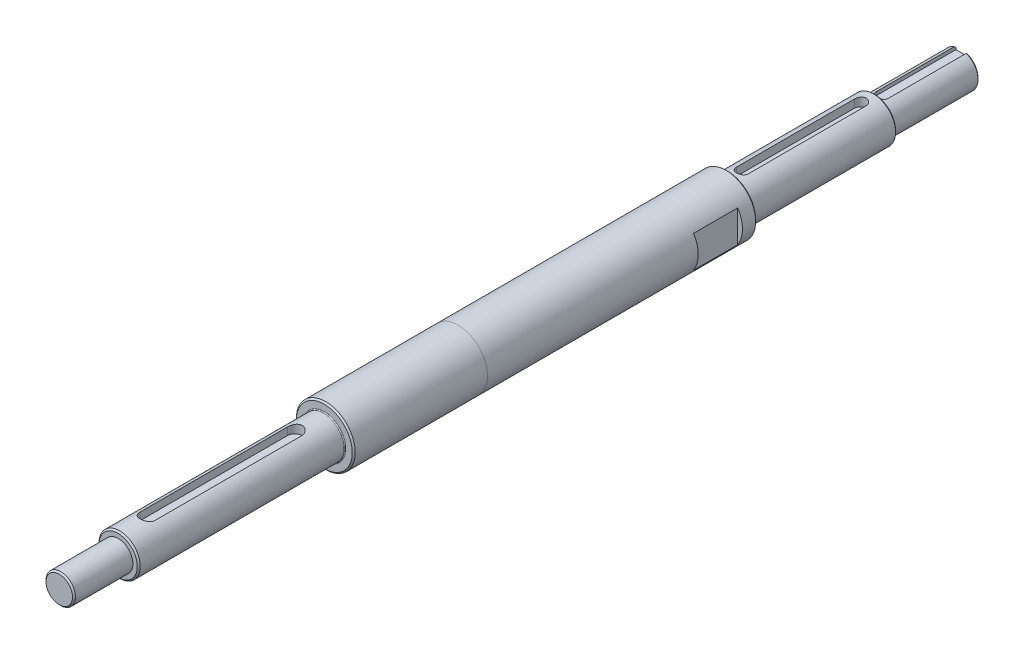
ISO-10303-21;
HEADER;
FILE_DESCRIPTION(('STEP AP214'),'2;1');
FILE_NAME('part.step','',(''),(''),'','','');
FILE_SCHEMA(('AUTOMOTIVE_DESIGN { 1 0 10303 214 1 1 1 1 }'));
ENDSEC;
DATA;
#1=APPLICATION_CONTEXT('core data for automotive mechanical design processes');
#2=APPLICATION_PROTOCOL_DEFINITION('international standard','automotive_design',2000,#1);
#3=PRODUCT_CONTEXT('',#1,'mechanical');
#4=PRODUCT('Part','Part','',(#3));
#5=PRODUCT_RELATED_PRODUCT_CATEGORY('part','',(#4));
#6=PRODUCT_DEFINITION_FORMATION('','',#4);
#7=PRODUCT_DEFINITION_CONTEXT('part definition',#1,'design');
#8=PRODUCT_DEFINITION('design','',#6,#7);
#9=PRODUCT_DEFINITION_SHAPE('','',#8);
#10=(LENGTH_UNIT() NAMED_UNIT(*) SI_UNIT(.MILLI.,.METRE.));
#11=(NAMED_UNIT(*) PLANE_ANGLE_UNIT() SI_UNIT($,.RADIAN.));
#12=(NAMED_UNIT(*) SI_UNIT($,.STERADIAN.) SOLID_ANGLE_UNIT());
#13=UNCERTAINTY_MEASURE_WITH_UNIT(LENGTH_MEASURE(1.E-05),#10,'distance_accuracy_value','');
#14=(GEOMETRIC_REPRESENTATION_CONTEXT(3) GLOBAL_UNCERTAINTY_ASSIGNED_CONTEXT((#13)) GLOBAL_UNIT_ASSIGNED_CONTEXT((#10,
#11,#12)) REPRESENTATION_CONTEXT('',''));
#15=CARTESIAN_POINT('',(0.,0.,0.));
#16=DIRECTION('',(0.,0.,1.));
#17=DIRECTION('',(1.,0.,0.));
#18=AXIS2_PLACEMENT_3D('',#15,#16,#17);
#19=CARTESIAN_POINT('',(0.,0.,0.));
#20=DIRECTION('',(0.,0.,1.));
#21=DIRECTION('',(1.,0.,0.));
#22=AXIS2_PLACEMENT_3D('',#19,#20,#21);
#23=CYLINDRICAL_SURFACE('',#22,9.99999999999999);
#24=CARTESIAN_POINT('',(0.,0.,-90.5));
#25=DIRECTION('',(0.,0.,-1.));
#26=DIRECTION('',(-1.,0.,0.));
#27=AXIS2_PLACEMENT_3D('',#24,#25,#26);
#28=CIRCLE('',#27,9.99999999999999);
#29=CARTESIAN_POINT('',(-9.99999999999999,0.,-90.5));
#30=VERTEX_POINT('',#29);
#31=EDGE_CURVE('E329',#30,#30,#28,.T.);
#32=ORIENTED_EDGE('',*,*,#31,.T.);
#33=EDGE_LOOP('',(#32));
#34=FACE_BOUND('',#33,.T.);
#35=CARTESIAN_POINT('',(0.,0.,-135.473865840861));
#36=DIRECTION('',(0.,0.,-1.));
#37=DIRECTION('',(-1.,0.,0.));
#38=AXIS2_PLACEMENT_3D('',#35,#36,#37);
#39=CIRCLE('',#38,9.99999999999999);
#40=CARTESIAN_POINT('',(-9.99999999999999,0.,-135.473865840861));
#41=VERTEX_POINT('',#40);
#42=EDGE_CURVE('E11',#41,#41,#39,.T.);
#43=ORIENTED_EDGE('',*,*,#42,.F.);
#44=EDGE_LOOP('',(#43));
#45=FACE_BOUND('',#44,.T.);
#46=ADVANCED_FACE('F39',(#34,#45),#23,.T.);
#47=CARTESIAN_POINT('',(0.,0.,0.));
#48=DIRECTION('',(0.,0.,1.));
#49=DIRECTION('',(1.,0.,0.));
#50=AXIS2_PLACEMENT_3D('',#47,#48,#49);
#51=CYLINDRICAL_SURFACE('',#50,7.5);
#52=CARTESIAN_POINT('',(0.,0.,-227.));
#53=DIRECTION('',(0.,0.,1.));
#54=DIRECTION('',(1.,0.,0.));
#55=AXIS2_PLACEMENT_3D('',#52,#53,#54);
#56=CIRCLE('',#55,7.5);
#57=CARTESIAN_POINT('',(7.5,0.,-227.));
#58=VERTEX_POINT('',#57);
#59=EDGE_CURVE('E260',#58,#58,#56,.T.);
#60=ORIENTED_EDGE('',*,*,#59,.F.);
#61=EDGE_LOOP('',(#60));
#62=FACE_BOUND('',#61,.T.);
#63=CARTESIAN_POINT('',(0.,0.,-276.5));
#64=DIRECTION('',(0.,0.,1.));
#65=DIRECTION('',(1.,0.,0.));
#66=AXIS2_PLACEMENT_3D('',#63,#64,#65);
#67=CIRCLE('',#66,7.5);
#68=CARTESIAN_POINT('',(7.5,0.,-276.5));
#69=VERTEX_POINT('',#68);
#70=EDGE_CURVE('E316',#69,#69,#67,.T.);
#71=ORIENTED_EDGE('',*,*,#70,.T.);
#72=EDGE_LOOP('',(#71));
#73=FACE_BOUND('',#72,.T.);
#74=CARTESIAN_POINT('',(-2.00000000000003,7.22841614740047,-232.));
#75=CARTESIAN_POINT('',(-2.00000081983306,7.22841211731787,-231.944805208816));
#76=CARTESIAN_POINT('',(-1.99771369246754,7.22904913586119,-231.88963790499));
#77=CARTESIAN_POINT('',(-1.98859723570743,7.23156375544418,-231.779718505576));
#78=CARTESIAN_POINT('',(-1.98176874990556,7.23344112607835,-231.724966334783));
#79=CARTESIAN_POINT('',(-1.9545755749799,7.2408568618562,-231.562171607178));
#80=CARTESIAN_POINT('',(-1.92750268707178,7.24817935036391,-231.455251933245));
#81=CARTESIAN_POINT('',(-1.85636209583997,7.26672221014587,-231.247687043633));
#82=CARTESIAN_POINT('',(-1.81229733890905,7.27794190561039,-231.147040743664));
#83=CARTESIAN_POINT('',(-1.70848322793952,7.30300813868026,-230.954511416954));
#84=CARTESIAN_POINT('',(-1.64872869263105,7.31685554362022,-230.86263129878));
#85=CARTESIAN_POINT('',(-1.51365040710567,7.34600093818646,-230.688008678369));
#86=CARTESIAN_POINT('',(-1.43800740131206,7.36132450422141,-230.605517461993));
#87=CARTESIAN_POINT('',(-1.2739794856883,7.39147614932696,-230.454222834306));
#88=CARTESIAN_POINT('',(-1.18559251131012,7.40630414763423,-230.385421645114));
#89=CARTESIAN_POINT('',(-0.996835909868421,7.43408021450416,-230.262413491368));
#90=CARTESIAN_POINT('',(-0.896297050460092,7.44699437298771,-230.208457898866));
#91=CARTESIAN_POINT('',(-0.68717790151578,7.4691917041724,-230.118313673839));
#92=CARTESIAN_POINT('',(-0.57859935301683,7.47847566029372,-230.082121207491));
#93=CARTESIAN_POINT('',(-0.359117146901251,7.49218546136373,-230.02934505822));
#94=CARTESIAN_POINT('',(-0.248323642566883,7.49671766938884,-230.012331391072));
#95=CARTESIAN_POINT('',(-0.0253660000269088,7.5007852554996,-229.997042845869));
#96=CARTESIAN_POINT('',(0.0867979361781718,7.50032136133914,-229.99876523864));
#97=CARTESIAN_POINT('',(0.306314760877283,7.49452674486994,-230.020597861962));
#98=CARTESIAN_POINT('',(0.413717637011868,7.48931908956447,-230.040243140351));
#99=CARTESIAN_POINT('',(0.623642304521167,7.47476739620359,-230.096612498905));
#100=CARTESIAN_POINT('',(0.726163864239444,7.46542316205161,-230.133337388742));
#101=CARTESIAN_POINT('',(0.924604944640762,7.44346557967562,-230.223180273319));
#102=CARTESIAN_POINT('',(1.02044860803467,7.43082062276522,-230.276457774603));
#103=CARTESIAN_POINT('',(1.20199173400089,7.40362439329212,-230.397770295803));
#104=CARTESIAN_POINT('',(1.28768941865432,7.38907278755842,-230.465807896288));
#105=CARTESIAN_POINT('',(1.44927650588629,7.35911436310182,-230.617168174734));
#106=CARTESIAN_POINT('',(1.52478554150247,7.34369500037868,-230.700894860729));
#107=CARTESIAN_POINT('',(1.66080031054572,7.31413713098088,-230.880005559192));
#108=CARTESIAN_POINT('',(1.72130189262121,7.29999897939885,-230.975392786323));
#109=CARTESIAN_POINT('',(1.82587959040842,7.27455088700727,-231.175957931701));
#110=CARTESIAN_POINT('',(1.86984307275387,7.26326050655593,-231.281197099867));
#111=CARTESIAN_POINT('',(1.93927349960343,7.24503473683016,-231.497888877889));
#112=CARTESIAN_POINT('',(1.96476823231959,7.23809280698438,-231.609331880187));
#113=CARTESIAN_POINT('',(1.98706167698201,7.23198573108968,-231.768137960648));
#114=CARTESIAN_POINT('',(1.99191398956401,7.23064946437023,-231.81440444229));
#115=CARTESIAN_POINT('',(1.99837971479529,7.22886491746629,-231.907106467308));
#116=CARTESIAN_POINT('',(1.99999825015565,7.22841523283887,-231.953541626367));
#117=CARTESIAN_POINT('',(1.99999999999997,7.22841614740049,-232.));
#118=B_SPLINE_CURVE_WITH_KNOTS('',3,(#74,#75,#76,#77,#78,#79,#80,#81,#82,#83,#84,#85,#86,#87,
#88,#89,#90,#91,#92,#93,#94,#95,#96,#97,#98,#99,#100,#101,#102,#103,#104,#105,#106,#107,#108,
#109,#110,#111,#112,#113,#114,#115,#116,#117),.UNSPECIFIED.,.F.,.F.,(4,2,2,2,2,2,2,2,2,2,2,2,2,
2,2,2,2,2,2,2,2,4),(0.,0.165479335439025,0.330927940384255,0.660821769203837,0.990658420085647,
1.32060413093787,1.65795310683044,1.99535679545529,2.33816399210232,2.68089716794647,
3.01578322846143,3.35062050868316,3.67701110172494,4.00341716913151,4.33307162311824,
4.6627837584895,5.00258485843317,5.34247984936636,5.68464951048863,6.02630326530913,
6.16582316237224,6.30512186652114),.UNSPECIFIED.);
#119=CARTESIAN_POINT('',(-2.00000000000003,7.22841614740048,-232.));
#120=VERTEX_POINT('',#119);
#121=CARTESIAN_POINT('',(1.99999999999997,7.22841614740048,-232.));
#122=VERTEX_POINT('',#121);
#123=EDGE_CURVE('E382',#120,#122,#118,.T.);
#124=ORIENTED_EDGE('',*,*,#123,.F.);
#125=DIRECTION('',(0.,0.,1.));
#126=VECTOR('',#125,1.);
#127=CARTESIAN_POINT('',(-2.,7.22841614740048,0.));
#128=LINE('',#127,#126);
#129=CARTESIAN_POINT('',(-2.,7.22841614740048,-272.));
#130=VERTEX_POINT('',#129);
#131=EDGE_CURVE('E347',#130,#120,#128,.T.);
#132=ORIENTED_EDGE('',*,*,#131,.F.);
#133=CARTESIAN_POINT('',(1.99999999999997,7.22841614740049,-272.));
#134=CARTESIAN_POINT('',(2.000000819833,7.22841211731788,-272.055194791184));
#135=CARTESIAN_POINT('',(1.99771369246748,7.22904913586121,-272.11036209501));
#136=CARTESIAN_POINT('',(1.98859723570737,7.2315637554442,-272.220281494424));
#137=CARTESIAN_POINT('',(1.98176874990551,7.23344112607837,-272.275033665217));
#138=CARTESIAN_POINT('',(1.95457557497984,7.24085686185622,-272.437828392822));
#139=CARTESIAN_POINT('',(1.92750268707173,7.24817935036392,-272.544748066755));
#140=CARTESIAN_POINT('',(1.85636209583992,7.26672221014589,-272.752312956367));
#141=CARTESIAN_POINT('',(1.81229733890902,7.27794190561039,-272.852959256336));
#142=CARTESIAN_POINT('',(1.70848322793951,7.30300813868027,-273.045488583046));
#143=CARTESIAN_POINT('',(1.64872869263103,7.31685554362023,-273.13736870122));
#144=CARTESIAN_POINT('',(1.51365040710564,7.34600093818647,-273.311991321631));
#145=CARTESIAN_POINT('',(1.43800740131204,7.36132450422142,-273.394482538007));
#146=CARTESIAN_POINT('',(1.27397948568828,7.39147614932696,-273.545777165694));
#147=CARTESIAN_POINT('',(1.18559251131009,7.40630414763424,-273.614578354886));
#148=CARTESIAN_POINT('',(0.99683590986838,7.43408021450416,-273.737586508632));
#149=CARTESIAN_POINT('',(0.896297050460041,7.44699437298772,-273.791542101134));
#150=CARTESIAN_POINT('',(0.687177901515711,7.46919170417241,-273.881686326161));
#151=CARTESIAN_POINT('',(0.578599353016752,7.47847566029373,-273.917878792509));
#152=CARTESIAN_POINT('',(0.35911714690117,7.49218546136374,-273.97065494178));
#153=CARTESIAN_POINT('',(0.248323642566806,7.49671766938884,-273.987668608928));
#154=CARTESIAN_POINT('',(0.0253660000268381,7.5007852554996,-274.002957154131));
#155=CARTESIAN_POINT('',(-0.0867979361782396,7.50032136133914,-274.001234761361));
#156=CARTESIAN_POINT('',(-0.306314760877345,7.49452674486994,-273.979402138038));
#157=CARTESIAN_POINT('',(-0.413717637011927,7.48931908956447,-273.959756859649));
#158=CARTESIAN_POINT('',(-0.623642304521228,7.47476739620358,-273.903387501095));
#159=CARTESIAN_POINT('',(-0.726163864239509,7.4654231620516,-273.866662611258));
#160=CARTESIAN_POINT('',(-0.924604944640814,7.44346557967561,-273.776819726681));
#161=CARTESIAN_POINT('',(-1.0204486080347,7.43082062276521,-273.723542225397));
#162=CARTESIAN_POINT('',(-1.20199173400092,7.40362439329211,-273.602229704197));
#163=CARTESIAN_POINT('',(-1.28768941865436,7.38907278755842,-273.534192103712));
#164=CARTESIAN_POINT('',(-1.44927650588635,7.35911436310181,-273.382831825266));
#165=CARTESIAN_POINT('',(-1.52478554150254,7.34369500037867,-273.299105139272));
#166=CARTESIAN_POINT('',(-1.6608003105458,7.31413713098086,-273.119994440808));
#167=CARTESIAN_POINT('',(-1.72130189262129,7.29999897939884,-273.024607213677));
#168=CARTESIAN_POINT('',(-1.82587959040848,7.27455088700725,-272.824042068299));
#169=CARTESIAN_POINT('',(-1.86984307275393,7.26326050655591,-272.718802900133));
#170=CARTESIAN_POINT('',(-1.93927349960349,7.24503473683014,-272.502111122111));
#171=CARTESIAN_POINT('',(-1.96476823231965,7.23809280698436,-272.390668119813));
#172=CARTESIAN_POINT('',(-1.98706167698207,7.23198573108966,-272.231862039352));
#173=CARTESIAN_POINT('',(-1.99191398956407,7.23064946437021,-272.18559555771));
#174=CARTESIAN_POINT('',(-1.99837971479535,7.22886491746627,-272.092893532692));
#175=CARTESIAN_POINT('',(-1.99999825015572,7.22841523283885,-272.046458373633));
#176=CARTESIAN_POINT('',(-2.00000000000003,7.22841614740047,-272.));
#177=B_SPLINE_CURVE_WITH_KNOTS('',3,(#133,#134,#135,#136,#137,#138,#139,#140,#141,#142,#143,
#144,#145,#146,#147,#148,#149,#150,#151,#152,#153,#154,#155,#156,#157,#158,#159,#160,#161,#162,
#163,#164,#165,#166,#167,#168,#169,#170,#171,#172,#173,#174,#175,#176),.UNSPECIFIED.,.F.,.F.,(4,
2,2,2,2,2,2,2,2,2,2,2,2,2,2,2,2,2,2,2,2,4),(0.,0.165479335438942,0.330927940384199,
0.660821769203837,0.990658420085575,1.32060413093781,1.65795310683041,1.99535679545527,
2.33816399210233,2.68089716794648,3.01578322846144,3.35062050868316,3.67701110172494,
4.00341716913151,4.33307162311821,4.66278375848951,5.00258485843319,5.34247984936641,
5.68464951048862,6.02630326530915,6.16582316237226,6.30512186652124),.UNSPECIFIED.);
#178=CARTESIAN_POINT('',(1.99999999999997,7.22841614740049,-272.));
#179=VERTEX_POINT('',#178);
#180=EDGE_CURVE('E349',#179,#130,#177,.T.);
#181=ORIENTED_EDGE('',*,*,#180,.F.);
#182=DIRECTION('',(0.,0.,1.));
#183=VECTOR('',#182,1.);
#184=CARTESIAN_POINT('',(1.99999999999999,7.22841614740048,0.));
#185=LINE('',#184,#183);
#186=EDGE_CURVE('E357',#122,#179,#185,.F.);
#187=ORIENTED_EDGE('',*,*,#186,.F.);
#188=EDGE_LOOP('',(#124,#132,#181,#187));
#189=FACE_BOUND('',#188,.T.);
#190=ADVANCED_FACE('F359',(#62,#73,#189),#51,.T.);
#191=CARTESIAN_POINT('',(0.,0.,0.));
#192=DIRECTION('',(0.,0.,1.));
#193=DIRECTION('',(1.,0.,0.));
#194=AXIS2_PLACEMENT_3D('',#191,#192,#193);
#195=CYLINDRICAL_SURFACE('',#194,6.99999999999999);
#196=CARTESIAN_POINT('',(0.,0.,-89.7));
#197=DIRECTION('',(0.,0.,-1.));
#198=DIRECTION('',(-1.,0.,0.));
#199=AXIS2_PLACEMENT_3D('',#196,#197,#198);
#200=CIRCLE('',#199,6.99999999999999);
#201=CARTESIAN_POINT('',(-6.99999999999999,0.,-89.7));
#202=VERTEX_POINT('',#201);
#203=EDGE_CURVE('E341',#202,#202,#200,.F.);
#204=ORIENTED_EDGE('',*,*,#203,.T.);
#205=EDGE_LOOP('',(#204));
#206=FACE_BOUND('',#205,.T.);
#207=CARTESIAN_POINT('',(0.,0.,-20.5));
#208=DIRECTION('',(0.,0.,-1.));
#209=DIRECTION('',(-1.,0.,0.));
#210=AXIS2_PLACEMENT_3D('',#207,#208,#209);
#211=CIRCLE('',#210,6.99999999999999);
#212=CARTESIAN_POINT('',(-6.99999999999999,0.,-20.5));
#213=VERTEX_POINT('',#212);
#214=EDGE_CURVE('E308',#213,#213,#211,.T.);
#215=ORIENTED_EDGE('',*,*,#214,.T.);
#216=EDGE_LOOP('',(#215));
#217=FACE_BOUND('',#216,.T.);
#218=CARTESIAN_POINT('',(-2.5,6.538348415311,-30.));
#219=CARTESIAN_POINT('',(-2.50000932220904,6.53833653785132,-29.9321107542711));
#220=CARTESIAN_POINT('',(-2.49723485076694,6.53940549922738,-29.8642280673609));
#221=CARTESIAN_POINT('',(-2.4861910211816,6.54361657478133,-29.7289960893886));
#222=CARTESIAN_POINT('',(-2.47792334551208,6.54675805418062,-29.6616466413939));
#223=CARTESIAN_POINT('',(-2.456001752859,6.55501217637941,-29.5281785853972));
#224=CARTESIAN_POINT('',(-2.44236559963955,6.56011831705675,-29.4620566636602));
#225=CARTESIAN_POINT('',(-2.40985115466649,6.57213177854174,-29.3312981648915));
#226=CARTESIAN_POINT('',(-2.39097263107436,6.57903917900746,-29.2666616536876));
#227=CARTESIAN_POINT('',(-2.32673964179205,6.60214934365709,-29.0757356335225));
#228=CARTESIAN_POINT('',(-2.27375112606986,6.62075475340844,-28.9522095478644));
#229=CARTESIAN_POINT('',(-2.14910757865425,6.66225397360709,-28.715769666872));
#230=CARTESIAN_POINT('',(-2.07743895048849,6.68515090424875,-28.6028636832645));
#231=CARTESIAN_POINT('',(-1.9140257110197,6.73379913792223,-28.3857847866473));
#232=CARTESIAN_POINT('',(-1.82158337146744,6.75962864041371,-28.2821535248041));
#233=CARTESIAN_POINT('',(-1.6207338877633,6.8105759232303,-28.0914912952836));
#234=CARTESIAN_POINT('',(-1.51232377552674,6.83569357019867,-28.0044634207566));
#235=CARTESIAN_POINT('',(-1.27853915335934,6.88331133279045,-27.846910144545));
#236=CARTESIAN_POINT('',(-1.15274833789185,6.90570835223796,-27.7769684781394));
#237=CARTESIAN_POINT('',(-0.890250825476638,6.94442357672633,-27.6594633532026));
#238=CARTESIAN_POINT('',(-0.753547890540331,6.96074386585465,-27.611892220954));
#239=CARTESIAN_POINT('',(-0.478829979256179,6.9849105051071,-27.5423593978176));
#240=CARTESIAN_POINT('',(-0.341079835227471,6.99306594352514,-27.5194608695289));
#241=CARTESIAN_POINT('',(-0.0634643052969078,7.00108798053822,-27.4969315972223));
#242=CARTESIAN_POINT('',(0.0764004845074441,7.00095687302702,-27.4972944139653));
#243=CARTESIAN_POINT('',(0.347593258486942,6.99262258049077,-27.5207112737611));
#244=CARTESIAN_POINT('',(0.479022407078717,6.98478243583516,-27.5427447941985));
#245=CARTESIAN_POINT('',(0.736175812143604,6.96237832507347,-27.6071734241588));
#246=CARTESIAN_POINT('',(0.86189974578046,6.94781397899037,-27.6495696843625));
#247=CARTESIAN_POINT('',(1.10616102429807,6.91316506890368,-27.7540469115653));
#248=CARTESIAN_POINT('',(1.22457279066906,6.89300592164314,-27.8163957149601));
#249=CARTESIAN_POINT('',(1.44953531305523,6.8492335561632,-27.9587793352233));
#250=CARTESIAN_POINT('',(1.5560824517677,6.82561928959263,-28.0388195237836));
#251=CARTESIAN_POINT('',(1.7603244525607,6.77590547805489,-28.2193232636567));
#252=CARTESIAN_POINT('',(1.85724185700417,6.74974055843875,-28.3206497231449));
#253=CARTESIAN_POINT('',(2.03299914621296,6.69890342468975,-28.5383273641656));
#254=CARTESIAN_POINT('',(2.11183255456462,6.67423174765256,-28.6546839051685));
#255=CARTESIAN_POINT('',(2.25049860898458,6.62877803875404,-28.901942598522));
#256=CARTESIAN_POINT('',(2.30994207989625,6.60807875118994,-29.0330789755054));
#257=CARTESIAN_POINT('',(2.40555439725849,6.57388213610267,-29.3043648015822));
#258=CARTESIAN_POINT('',(2.44176119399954,6.56037307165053,-29.444499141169));
#259=CARTESIAN_POINT('',(2.47705497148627,6.54708542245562,-29.6550305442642));
#260=CARTESIAN_POINT('',(2.48565347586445,6.54382010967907,-29.7237363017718));
#261=CARTESIAN_POINT('',(2.49712352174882,6.53944910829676,-29.8616151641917));
#262=CARTESIAN_POINT('',(2.50000139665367,6.53834103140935,-29.9307876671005));
#263=CARTESIAN_POINT('',(2.5,6.53834841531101,-30.));
#264=B_SPLINE_CURVE_WITH_KNOTS('',3,(#218,#219,#220,#221,#222,#223,#224,#225,#226,#227,#228,
#229,#230,#231,#232,#233,#234,#235,#236,#237,#238,#239,#240,#241,#242,#243,#244,#245,#246,#247,
#248,#249,#250,#251,#252,#253,#254,#255,#256,#257,#258,#259,#260,#261,#262,#263),.UNSPECIFIED.,
.F.,.F.,(4,2,2,2,2,2,2,2,2,2,2,2,2,2,2,2,2,2,2,2,2,2,4),(0.,0.203591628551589,0.407120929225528,
0.609982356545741,0.812852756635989,1.21793118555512,1.6233052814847,2.0451597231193,
2.4670926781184,2.90188398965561,3.33652604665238,3.75400993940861,4.17137826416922,
4.56998920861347,4.96862268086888,5.37284909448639,5.77719841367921,6.20315837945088,
6.6292706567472,7.06347329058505,7.49696496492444,7.70468580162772,7.91217653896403),.UNSPECIFIED.);
#265=CARTESIAN_POINT('',(-2.5,6.538348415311,-30.));
#266=VERTEX_POINT('',#265);
#267=CARTESIAN_POINT('',(2.5,6.538348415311,-30.));
#268=VERTEX_POINT('',#267);
#269=EDGE_CURVE('E300',#266,#268,#264,.T.);
#270=ORIENTED_EDGE('',*,*,#269,.F.);
#271=DIRECTION('',(0.,0.,1.));
#272=VECTOR('',#271,1.);
#273=CARTESIAN_POINT('',(-2.5,6.538348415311,0.));
#274=LINE('',#273,#272);
#275=CARTESIAN_POINT('',(-2.5,6.538348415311,-80.));
#276=VERTEX_POINT('',#275);
#277=EDGE_CURVE('E266',#276,#266,#274,.T.);
#278=ORIENTED_EDGE('',*,*,#277,.F.);
#279=CARTESIAN_POINT('',(2.49999999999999,6.53834841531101,-80.));
#280=CARTESIAN_POINT('',(2.50000932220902,6.53833653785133,-80.0678892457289));
#281=CARTESIAN_POINT('',(2.49723485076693,6.53940549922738,-80.1357719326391));
#282=CARTESIAN_POINT('',(2.48619102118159,6.54361657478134,-80.2710039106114));
#283=CARTESIAN_POINT('',(2.47792334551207,6.54675805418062,-80.3383533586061));
#284=CARTESIAN_POINT('',(2.45600175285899,6.55501217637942,-80.4718214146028));
#285=CARTESIAN_POINT('',(2.44236559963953,6.56011831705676,-80.5379433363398));
#286=CARTESIAN_POINT('',(2.40985115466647,6.57213177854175,-80.6687018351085));
#287=CARTESIAN_POINT('',(2.39097263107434,6.57903917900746,-80.7333383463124));
#288=CARTESIAN_POINT('',(2.32673964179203,6.60214934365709,-80.9242643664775));
#289=CARTESIAN_POINT('',(2.27375112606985,6.62075475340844,-81.0477904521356));
#290=CARTESIAN_POINT('',(2.14910757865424,6.6622539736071,-81.284230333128));
#291=CARTESIAN_POINT('',(2.07743895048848,6.68515090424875,-81.3971363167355));
#292=CARTESIAN_POINT('',(1.91402571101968,6.73379913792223,-81.6142152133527));
#293=CARTESIAN_POINT('',(1.82158337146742,6.75962864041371,-81.7178464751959));
#294=CARTESIAN_POINT('',(1.62073388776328,6.81057592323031,-81.9085087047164));
#295=CARTESIAN_POINT('',(1.51232377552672,6.83569357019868,-81.9955365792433));
#296=CARTESIAN_POINT('',(1.27853915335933,6.88331133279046,-82.153089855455));
#297=CARTESIAN_POINT('',(1.15274833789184,6.90570835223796,-82.2230315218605));
#298=CARTESIAN_POINT('',(0.890250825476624,6.94442357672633,-82.3405366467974));
#299=CARTESIAN_POINT('',(0.753547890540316,6.96074386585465,-82.388107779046));
#300=CARTESIAN_POINT('',(0.478829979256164,6.9849105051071,-82.4576406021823));
#301=CARTESIAN_POINT('',(0.341079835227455,6.99306594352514,-82.4805391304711));
#302=CARTESIAN_POINT('',(0.0634643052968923,7.00108798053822,-82.5030684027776));
#303=CARTESIAN_POINT('',(-0.0764004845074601,7.00095687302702,-82.5027055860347));
#304=CARTESIAN_POINT('',(-0.347593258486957,6.99262258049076,-82.4792887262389));
#305=CARTESIAN_POINT('',(-0.479022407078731,6.98478243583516,-82.4572552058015));
#306=CARTESIAN_POINT('',(-0.736175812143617,6.96237832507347,-82.3928265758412));
#307=CARTESIAN_POINT('',(-0.861899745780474,6.94781397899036,-82.3504303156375));
#308=CARTESIAN_POINT('',(-1.10616102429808,6.91316506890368,-82.2459530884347));
#309=CARTESIAN_POINT('',(-1.22457279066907,6.89300592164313,-82.1836042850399));
#310=CARTESIAN_POINT('',(-1.44953531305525,6.8492335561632,-82.0412206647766));
#311=CARTESIAN_POINT('',(-1.55608245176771,6.82561928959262,-81.9611804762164));
#312=CARTESIAN_POINT('',(-1.76032445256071,6.77590547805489,-81.7806767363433));
#313=CARTESIAN_POINT('',(-1.85724185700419,6.74974055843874,-81.6793502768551));
#314=CARTESIAN_POINT('',(-2.03299914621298,6.69890342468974,-81.4616726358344));
#315=CARTESIAN_POINT('',(-2.11183255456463,6.67423174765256,-81.3453160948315));
#316=CARTESIAN_POINT('',(-2.25049860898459,6.62877803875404,-81.098057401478));
#317=CARTESIAN_POINT('',(-2.30994207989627,6.60807875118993,-80.9669210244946));
#318=CARTESIAN_POINT('',(-2.40555439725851,6.57388213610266,-80.6956351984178));
#319=CARTESIAN_POINT('',(-2.44176119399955,6.56037307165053,-80.555500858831));
#320=CARTESIAN_POINT('',(-2.47705497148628,6.54708542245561,-80.3449694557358));
#321=CARTESIAN_POINT('',(-2.48565347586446,6.54382010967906,-80.2762636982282));
#322=CARTESIAN_POINT('',(-2.49712352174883,6.53944910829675,-80.1383848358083));
#323=CARTESIAN_POINT('',(-2.50000139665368,6.53834103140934,-80.0692123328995));
#324=CARTESIAN_POINT('',(-2.50000000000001,6.538348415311,-80.));
#325=B_SPLINE_CURVE_WITH_KNOTS('',3,(#279,#280,#281,#282,#283,#284,#285,#286,#287,#288,#289,
#290,#291,#292,#293,#294,#295,#296,#297,#298,#299,#300,#301,#302,#303,#304,#305,#306,#307,#308,
#309,#310,#311,#312,#313,#314,#315,#316,#317,#318,#319,#320,#321,#322,#323,#324),.UNSPECIFIED.,
.F.,.F.,(4,2,2,2,2,2,2,2,2,2,2,2,2,2,2,2,2,2,2,2,2,2,4),(0.,0.203591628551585,0.407120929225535,
0.609982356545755,0.812852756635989,1.21793118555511,1.6233052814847,2.04515972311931,
2.4670926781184,2.90188398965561,3.33652604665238,3.75400993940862,4.17137826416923,
4.56998920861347,4.96862268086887,5.3728490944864,5.77719841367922,6.20315837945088,
6.62927065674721,7.06347329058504,7.49696496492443,7.70468580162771,7.91217653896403),.UNSPECIFIED.);
#326=CARTESIAN_POINT('',(2.49999999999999,6.53834841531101,-80.));
#327=VERTEX_POINT('',#326);
#328=EDGE_CURVE('E268',#327,#276,#325,.T.);
#329=ORIENTED_EDGE('',*,*,#328,.F.);
#330=DIRECTION('',(0.,0.,1.));
#331=VECTOR('',#330,1.);
#332=CARTESIAN_POINT('',(2.5,6.538348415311,0.));
#333=LINE('',#332,#331);
#334=EDGE_CURVE('E276',#268,#327,#333,.F.);
#335=ORIENTED_EDGE('',*,*,#334,.F.);
#336=EDGE_LOOP('',(#270,#278,#329,#335));
#337=FACE_BOUND('',#336,.T.);
#338=ADVANCED_FACE('F278',(#206,#217,#337),#195,.T.);
#339=CARTESIAN_POINT('',(0.,5.,0.));
#340=DIRECTION('',(0.,0.,-1.));
#341=DIRECTION('',(-1.,0.,0.));
#342=AXIS2_PLACEMENT_3D('',#339,#340,#341);
#343=PLANE('',#342);
#344=CARTESIAN_POINT('',(0.,0.,0.));
#345=DIRECTION('',(0.,0.,-1.));
#346=DIRECTION('',(-1.,0.,0.));
#347=AXIS2_PLACEMENT_3D('',#344,#345,#346);
#348=CIRCLE('',#347,4.50000000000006);
#349=CARTESIAN_POINT('',(-4.50000000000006,0.,0.));
#350=VERTEX_POINT('',#349);
#351=EDGE_CURVE('E335',#350,#350,#348,.F.);
#352=ORIENTED_EDGE('',*,*,#351,.T.);
#353=EDGE_LOOP('',(#352));
#354=FACE_BOUND('',#353,.T.);
#355=ADVANCED_FACE('F41',(#354),#343,.F.);
#356=CARTESIAN_POINT('',(0.,0.,0.));
#357=DIRECTION('',(0.,0.,1.));
#358=DIRECTION('',(1.,0.,0.));
#359=AXIS2_PLACEMENT_3D('',#356,#357,#358);
#360=CYLINDRICAL_SURFACE('',#359,5.);
#361=CARTESIAN_POINT('',(0.,0.,-0.499999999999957));
#362=DIRECTION('',(0.,0.,-1.));
#363=DIRECTION('',(-1.,0.,0.));
#364=AXIS2_PLACEMENT_3D('',#361,#362,#363);
#365=CIRCLE('',#364,5.);
#366=CARTESIAN_POINT('',(-5.,0.,-0.499999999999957));
#367=VERTEX_POINT('',#366);
#368=EDGE_CURVE('E338',#367,#367,#365,.T.);
#369=ORIENTED_EDGE('',*,*,#368,.T.);
#370=EDGE_LOOP('',(#369));
#371=FACE_BOUND('',#370,.T.);
#372=CARTESIAN_POINT('',(0.,0.,-20.));
#373=DIRECTION('',(0.,0.,1.));
#374=DIRECTION('',(1.,0.,0.));
#375=AXIS2_PLACEMENT_3D('',#372,#373,#374);
#376=CIRCLE('',#375,5.);
#377=CARTESIAN_POINT('',(5.,0.,-20.));
#378=VERTEX_POINT('',#377);
#379=EDGE_CURVE('E263',#378,#378,#376,.T.);
#380=ORIENTED_EDGE('',*,*,#379,.T.);
#381=EDGE_LOOP('',(#380));
#382=FACE_BOUND('',#381,.T.);
#383=ADVANCED_FACE('F784',(#371,#382),#360,.T.);
#384=CARTESIAN_POINT('',(0.,5.,-20.));
#385=DIRECTION('',(0.,0.,-1.));
#386=DIRECTION('',(-1.,0.,0.));
#387=AXIS2_PLACEMENT_3D('',#384,#385,#386);
#388=PLANE('',#387);
#389=CARTESIAN_POINT('',(0.,0.,-20.));
#390=DIRECTION('',(0.,0.,-1.));
#391=DIRECTION('',(-1.,0.,0.));
#392=AXIS2_PLACEMENT_3D('',#389,#390,#391);
#393=CIRCLE('',#392,6.50000000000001);
#394=CARTESIAN_POINT('',(-6.50000000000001,0.,-20.));
#395=VERTEX_POINT('',#394);
#396=EDGE_CURVE('E305',#395,#395,#393,.F.);
#397=ORIENTED_EDGE('',*,*,#396,.T.);
#398=EDGE_LOOP('',(#397));
#399=FACE_BOUND('',#398,.T.);
#400=ORIENTED_EDGE('',*,*,#379,.F.);
#401=EDGE_LOOP('',(#400));
#402=FACE_BOUND('',#401,.T.);
#403=ADVANCED_FACE('F494',(#399,#402),#388,.F.);
#404=CARTESIAN_POINT('',(0.,9.99999999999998,-90.));
#405=DIRECTION('',(0.,0.,-1.));
#406=DIRECTION('',(-1.,0.,0.));
#407=AXIS2_PLACEMENT_3D('',#404,#405,#406);
#408=PLANE('',#407);
#409=CARTESIAN_POINT('',(0.,0.,-90.));
#410=DIRECTION('',(0.,0.,-1.));
#411=DIRECTION('',(-1.,0.,0.));
#412=AXIS2_PLACEMENT_3D('',#409,#410,#411);
#413=CIRCLE('',#412,7.29999999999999);
#414=CARTESIAN_POINT('',(-7.29999999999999,0.,-90.));
#415=VERTEX_POINT('',#414);
#416=EDGE_CURVE('E344',#415,#415,#413,.T.);
#417=ORIENTED_EDGE('',*,*,#416,.T.);
#418=EDGE_LOOP('',(#417));
#419=FACE_BOUND('',#418,.T.);
#420=CARTESIAN_POINT('',(0.,0.,-90.));
#421=DIRECTION('',(0.,0.,-1.));
#422=DIRECTION('',(-1.,0.,0.));
#423=AXIS2_PLACEMENT_3D('',#420,#421,#422);
#424=CIRCLE('',#423,9.50000000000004);
#425=CARTESIAN_POINT('',(-9.50000000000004,0.,-90.));
#426=VERTEX_POINT('',#425);
#427=EDGE_CURVE('E322',#426,#426,#424,.F.);
#428=ORIENTED_EDGE('',*,*,#427,.T.);
#429=EDGE_LOOP('',(#428));
#430=FACE_BOUND('',#429,.T.);
#431=ADVANCED_FACE('F486',(#419,#430),#408,.F.);
#432=ORIENTED_EDGE('',*,*,#42,.T.);
#433=EDGE_LOOP('',(#432));
#434=FACE_BOUND('',#433,.T.);
#435=CARTESIAN_POINT('',(0.,0.,-222.));
#436=DIRECTION('',(0.,0.,-1.));
#437=DIRECTION('',(-1.,0.,0.));
#438=AXIS2_PLACEMENT_3D('',#435,#436,#437);
#439=CIRCLE('',#438,9.99999999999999);
#440=CARTESIAN_POINT('',(-8.39999999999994,-5.42586398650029,-222.));
#441=VERTEX_POINT('',#440);
#442=CARTESIAN_POINT('',(-8.39999999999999,5.42586398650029,-222.));
#443=VERTEX_POINT('',#442);
#444=EDGE_CURVE('E404',#441,#443,#439,.T.);
#445=ORIENTED_EDGE('',*,*,#444,.T.);
#446=DIRECTION('',(0.,0.,1.));
#447=VECTOR('',#446,1.);
#448=CARTESIAN_POINT('',(-8.39999999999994,5.42586398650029,0.));
#449=LINE('',#448,#447);
#450=CARTESIAN_POINT('',(-8.39999999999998,5.42586398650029,-182.));
#451=VERTEX_POINT('',#450);
#452=EDGE_CURVE('E410',#443,#451,#449,.T.);
#453=ORIENTED_EDGE('',*,*,#452,.T.);
#454=CARTESIAN_POINT('',(0.,0.,-182.));
#455=DIRECTION('',(0.,0.,1.));
#456=DIRECTION('',(1.,0.,0.));
#457=AXIS2_PLACEMENT_3D('',#454,#455,#456);
#458=CIRCLE('',#457,9.99999999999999);
#459=CARTESIAN_POINT('',(-8.39999999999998,-5.42586398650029,-182.));
#460=VERTEX_POINT('',#459);
#461=EDGE_CURVE('E407',#451,#460,#458,.T.);
#462=ORIENTED_EDGE('',*,*,#461,.T.);
#463=DIRECTION('',(0.,0.,1.));
#464=VECTOR('',#463,1.);
#465=CARTESIAN_POINT('',(-8.39999999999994,-5.42586398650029,0.));
#466=LINE('',#465,#464);
#467=EDGE_CURVE('E401',#460,#441,#466,.F.);
#468=ORIENTED_EDGE('',*,*,#467,.T.);
#469=EDGE_LOOP('',(#445,#453,#462,#468));
#470=FACE_BOUND('',#469,.T.);
#471=DIRECTION('',(0.,0.,1.));
#472=VECTOR('',#471,1.);
#473=CARTESIAN_POINT('',(8.40000000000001,-5.42586398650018,0.));
#474=LINE('',#473,#472);
#475=CARTESIAN_POINT('',(8.40000000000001,-5.42586398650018,-222.));
#476=VERTEX_POINT('',#475);
#477=CARTESIAN_POINT('',(8.40000000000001,-5.42586398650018,-207.));
#478=VERTEX_POINT('',#477);
#479=EDGE_CURVE('E394',#476,#478,#474,.T.);
#480=ORIENTED_EDGE('',*,*,#479,.T.);
#481=CARTESIAN_POINT('',(0.,0.,-207.));
#482=DIRECTION('',(0.,0.,1.));
#483=DIRECTION('',(1.,0.,0.));
#484=AXIS2_PLACEMENT_3D('',#481,#482,#483);
#485=CIRCLE('',#484,9.99999999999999);
#486=CARTESIAN_POINT('',(8.40000000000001,5.42586398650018,-207.));
#487=VERTEX_POINT('',#486);
#488=EDGE_CURVE('E398',#478,#487,#485,.T.);
#489=ORIENTED_EDGE('',*,*,#488,.T.);
#490=DIRECTION('',(0.,0.,1.));
#491=VECTOR('',#490,1.);
#492=CARTESIAN_POINT('',(8.40000000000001,5.42586398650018,0.));
#493=LINE('',#492,#491);
#494=CARTESIAN_POINT('',(8.40000000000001,5.42586398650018,-222.));
#495=VERTEX_POINT('',#494);
#496=EDGE_CURVE('E390',#487,#495,#493,.F.);
#497=ORIENTED_EDGE('',*,*,#496,.T.);
#498=CARTESIAN_POINT('',(0.,0.,-222.));
#499=DIRECTION('',(0.,0.,-1.));
#500=DIRECTION('',(-1.,0.,0.));
#501=AXIS2_PLACEMENT_3D('',#498,#499,#500);
#502=CIRCLE('',#501,9.99999999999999);
#503=EDGE_CURVE('E387',#495,#476,#502,.T.);
#504=ORIENTED_EDGE('',*,*,#503,.T.);
#505=EDGE_LOOP('',(#480,#489,#497,#504));
#506=FACE_BOUND('',#505,.T.);
#507=CARTESIAN_POINT('',(0.,0.,-226.5));
#508=DIRECTION('',(0.,0.,1.));
#509=DIRECTION('',(1.,0.,0.));
#510=AXIS2_PLACEMENT_3D('',#507,#508,#509);
#511=CIRCLE('',#510,9.99999999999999);
#512=CARTESIAN_POINT('',(9.99999999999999,0.,-226.5));
#513=VERTEX_POINT('',#512);
#514=EDGE_CURVE('E325',#513,#513,#511,.T.);
#515=ORIENTED_EDGE('',*,*,#514,.T.);
#516=EDGE_LOOP('',(#515));
#517=FACE_BOUND('',#516,.T.);
#518=ADVANCED_FACE('F478',(#434,#470,#506,#517),#23,.T.);
#519=CARTESIAN_POINT('',(0.,7.5,-227.));
#520=DIRECTION('',(0.,0.,1.));
#521=DIRECTION('',(1.,0.,0.));
#522=AXIS2_PLACEMENT_3D('',#519,#520,#521);
#523=PLANE('',#522);
#524=CARTESIAN_POINT('',(0.,0.,-227.));
#525=DIRECTION('',(0.,0.,1.));
#526=DIRECTION('',(1.,0.,0.));
#527=AXIS2_PLACEMENT_3D('',#524,#525,#526);
#528=CIRCLE('',#527,9.50000000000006);
#529=CARTESIAN_POINT('',(9.50000000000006,0.,-227.));
#530=VERTEX_POINT('',#529);
#531=EDGE_CURVE('E332',#530,#530,#528,.F.);
#532=ORIENTED_EDGE('',*,*,#531,.T.);
#533=EDGE_LOOP('',(#532));
#534=FACE_BOUND('',#533,.T.);
#535=ORIENTED_EDGE('',*,*,#59,.T.);
#536=EDGE_LOOP('',(#535));
#537=FACE_BOUND('',#536,.T.);
#538=ADVANCED_FACE('F485',(#534,#537),#523,.F.);
#539=CARTESIAN_POINT('',(0.,7.5,-277.));
#540=DIRECTION('',(0.,0.,1.));
#541=DIRECTION('',(1.,0.,0.));
#542=AXIS2_PLACEMENT_3D('',#539,#540,#541);
#543=PLANE('',#542);
#544=CARTESIAN_POINT('',(0.,0.,-277.));
#545=DIRECTION('',(0.,0.,1.));
#546=DIRECTION('',(1.,0.,0.));
#547=AXIS2_PLACEMENT_3D('',#544,#545,#546);
#548=CIRCLE('',#547,7.00000000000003);
#549=CARTESIAN_POINT('',(7.00000000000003,0.,-277.));
#550=VERTEX_POINT('',#549);
#551=EDGE_CURVE('E319',#550,#550,#548,.F.);
#552=ORIENTED_EDGE('',*,*,#551,.T.);
#553=EDGE_LOOP('',(#552));
#554=FACE_BOUND('',#553,.T.);
#555=CARTESIAN_POINT('',(0.,0.,-277.));
#556=DIRECTION('',(0.,0.,1.));
#557=DIRECTION('',(1.,0.,0.));
#558=AXIS2_PLACEMENT_3D('',#555,#556,#557);
#559=CIRCLE('',#558,6.);
#560=CARTESIAN_POINT('',(6.,0.,-277.));
#561=VERTEX_POINT('',#560);
#562=EDGE_CURVE('E257',#561,#561,#559,.T.);
#563=ORIENTED_EDGE('',*,*,#562,.T.);
#564=EDGE_LOOP('',(#563));
#565=FACE_BOUND('',#564,.T.);
#566=ADVANCED_FACE('F492',(#554,#565),#543,.F.);
#567=CARTESIAN_POINT('',(0.,0.,0.));
#568=DIRECTION('',(0.,0.,1.));
#569=DIRECTION('',(1.,0.,0.));
#570=AXIS2_PLACEMENT_3D('',#567,#568,#569);
#571=CYLINDRICAL_SURFACE('',#570,6.);
#572=CARTESIAN_POINT('',(0.,0.,-306.));
#573=DIRECTION('',(0.,0.,1.));
#574=DIRECTION('',(1.,0.,0.));
#575=AXIS2_PLACEMENT_3D('',#572,#573,#574);
#576=CIRCLE('',#575,6.);
#577=CARTESIAN_POINT('',(-2.,5.65685424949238,-306.));
#578=VERTEX_POINT('',#577);
#579=CARTESIAN_POINT('',(2.,5.65685424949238,-306.));
#580=VERTEX_POINT('',#579);
#581=EDGE_CURVE('E311',#578,#580,#576,.T.);
#582=ORIENTED_EDGE('',*,*,#581,.T.);
#583=DIRECTION('',(0.,0.,1.));
#584=VECTOR('',#583,1.);
#585=CARTESIAN_POINT('',(2.,5.65685424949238,0.));
#586=LINE('',#585,#584);
#587=CARTESIAN_POINT('',(2.,5.65685424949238,-279.5));
#588=VERTEX_POINT('',#587);
#589=EDGE_CURVE('E198',#580,#588,#586,.T.);
#590=ORIENTED_EDGE('',*,*,#589,.T.);
#591=CARTESIAN_POINT('',(2.,5.65685424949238,-279.5));
#592=CARTESIAN_POINT('',(2.00000149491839,5.65684884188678,-279.445419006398));
#593=CARTESIAN_POINT('',(1.99776424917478,5.6576451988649,-279.390865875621));
#594=CARTESIAN_POINT('',(1.9888512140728,5.66078654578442,-279.28218283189));
#595=CARTESIAN_POINT('',(1.98217662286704,5.66313111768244,-279.228052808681));
#596=CARTESIAN_POINT('',(1.95562135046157,5.67238184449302,-279.06721571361));
#597=CARTESIAN_POINT('',(1.92920846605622,5.6815058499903,-278.961638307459));
#598=CARTESIAN_POINT('',(1.85991682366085,5.70456149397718,-278.756749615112));
#599=CARTESIAN_POINT('',(1.81704715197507,5.71849047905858,-278.657434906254));
#600=CARTESIAN_POINT('',(1.71614645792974,5.74957574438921,-278.467320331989));
#601=CARTESIAN_POINT('',(1.65810612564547,5.76673400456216,-278.376525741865));
#602=CARTESIAN_POINT('',(1.52610278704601,5.80308960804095,-278.202559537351));
#603=CARTESIAN_POINT('',(1.45164996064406,5.82233755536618,-278.119770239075));
#604=CARTESIAN_POINT('',(1.28997688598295,5.86027697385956,-277.967587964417));
#605=CARTESIAN_POINT('',(1.20275436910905,5.87896834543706,-277.898197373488));
#606=CARTESIAN_POINT('',(1.0152072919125,5.91427765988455,-277.773040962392));
#607=CARTESIAN_POINT('',(0.914600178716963,5.93082875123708,-277.717678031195));
#608=CARTESIAN_POINT('',(0.704858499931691,5.95939217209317,-277.624815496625));
#609=CARTESIAN_POINT('',(0.59572655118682,5.97140588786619,-277.587310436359));
#610=CARTESIAN_POINT('',(0.376058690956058,5.98918142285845,-277.532528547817));
#611=CARTESIAN_POINT('',(0.265703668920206,5.99514617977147,-277.514593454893));
#612=CARTESIAN_POINT('',(0.0433979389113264,6.00087216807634,-277.497367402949));
#613=CARTESIAN_POINT('',(-0.068552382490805,6.00063487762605,-277.49807200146));
#614=CARTESIAN_POINT('',(-0.286207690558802,5.99412077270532,-277.517688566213));
#615=CARTESIAN_POINT('',(-0.391985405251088,5.98808121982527,-277.535885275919));
#616=CARTESIAN_POINT('',(-0.598888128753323,5.97093921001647,-277.588786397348));
#617=CARTESIAN_POINT('',(-0.700012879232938,5.95983647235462,-277.623491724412));
#618=CARTESIAN_POINT('',(-0.896305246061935,5.93351336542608,-277.708842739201));
#619=CARTESIAN_POINT('',(-0.991377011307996,5.91824075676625,-277.759692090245));
#620=CARTESIAN_POINT('',(-1.17184917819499,5.88516775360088,-277.875719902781));
#621=CARTESIAN_POINT('',(-1.25724693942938,5.86736667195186,-277.940902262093));
#622=CARTESIAN_POINT('',(-1.42019467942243,5.83012543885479,-278.087342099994));
#623=CARTESIAN_POINT('',(-1.49718722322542,5.81064757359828,-278.169211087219));
#624=CARTESIAN_POINT('',(-1.63654404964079,5.77294980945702,-278.344882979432));
#625=CARTESIAN_POINT('',(-1.69890360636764,5.75473031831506,-278.438689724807));
#626=CARTESIAN_POINT('',(-1.80800665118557,5.72140062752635,-278.637360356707));
#627=CARTESIAN_POINT('',(-1.85450601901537,5.70634029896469,-278.742367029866));
#628=CARTESIAN_POINT('',(-1.92892046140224,5.68162194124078,-278.95929395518));
#629=CARTESIAN_POINT('',(-1.95686487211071,5.67195538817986,-279.071202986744));
#630=CARTESIAN_POINT('',(-1.98331631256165,5.6627308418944,-279.236837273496));
#631=CARTESIAN_POINT('',(-1.98957012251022,5.66053335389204,-279.289282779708));
#632=CARTESIAN_POINT('',(-1.99790923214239,5.65759407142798,-279.3944761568));
#633=CARTESIAN_POINT('',(-1.99999991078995,5.65685039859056,-279.447223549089));
#634=CARTESIAN_POINT('',(-2.,5.65685424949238,-279.5));
#635=B_SPLINE_CURVE_WITH_KNOTS('',3,(#591,#592,#593,#594,#595,#596,#597,#598,#599,#600,#601,
#602,#603,#604,#605,#606,#607,#608,#609,#610,#611,#612,#613,#614,#615,#616,#617,#618,#619,#620,
#621,#622,#623,#624,#625,#626,#627,#628,#629,#630,#631,#632,#633,#634),.UNSPECIFIED.,.F.,.F.,(4,
2,2,2,2,2,2,2,2,2,2,2,2,2,2,2,2,2,2,2,2,4),(0.,0.163636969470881,0.327229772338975,
0.653162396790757,0.978915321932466,1.30486862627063,1.64233009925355,1.97985159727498,
2.32618265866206,2.67240782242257,3.00658941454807,3.34069136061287,3.66168836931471,
3.98270317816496,4.30794037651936,4.6332661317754,4.97388108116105,5.31460588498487,
5.66036059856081,6.00556734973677,6.16399790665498,6.32222363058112),.UNSPECIFIED.);
#636=CARTESIAN_POINT('',(-2.,5.6568542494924,-279.5));
#637=VERTEX_POINT('',#636);
#638=EDGE_CURVE('E48',#588,#637,#635,.T.);
#639=ORIENTED_EDGE('',*,*,#638,.T.);
#640=DIRECTION('',(0.,0.,1.));
#641=VECTOR('',#640,1.);
#642=CARTESIAN_POINT('',(-1.99999999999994,5.6568542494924,0.));
#643=LINE('',#642,#641);
#644=EDGE_CURVE('E191',#637,#578,#643,.F.);
#645=ORIENTED_EDGE('',*,*,#644,.T.);
#646=EDGE_LOOP('',(#582,#590,#639,#645));
#647=FACE_BOUND('',#646,.T.);
#648=ORIENTED_EDGE('',*,*,#562,.F.);
#649=EDGE_LOOP('',(#648));
#650=FACE_BOUND('',#649,.T.);
#651=ADVANCED_FACE('F544',(#647,#650),#571,.T.);
#652=CARTESIAN_POINT('',(0.,6.,-306.5));
#653=DIRECTION('',(0.,0.,1.));
#654=DIRECTION('',(1.,0.,0.));
#655=AXIS2_PLACEMENT_3D('',#652,#653,#654);
#656=PLANE('',#655);
#657=CARTESIAN_POINT('',(0.,0.,-306.5));
#658=DIRECTION('',(0.,0.,-1.));
#659=DIRECTION('',(-1.,0.,0.));
#660=AXIS2_PLACEMENT_3D('',#657,#658,#659);
#661=CIRCLE('',#660,2.5);
#662=CARTESIAN_POINT('',(-2.5,0.,-306.5));
#663=VERTEX_POINT('',#662);
#664=EDGE_CURVE('E214',#663,#663,#661,.T.);
#665=ORIENTED_EDGE('',*,*,#664,.F.);
#666=EDGE_LOOP('',(#665));
#667=FACE_BOUND('',#666,.T.);
#668=DIRECTION('',(-1.,0.,0.));
#669=VECTOR('',#668,1.);
#670=CARTESIAN_POINT('',(2.,4.5,-306.5));
#671=LINE('',#670,#669);
#672=CARTESIAN_POINT('',(2.,4.5,-306.5));
#673=VERTEX_POINT('',#672);
#674=CARTESIAN_POINT('',(-2.,4.5,-306.5));
#675=VERTEX_POINT('',#674);
#676=EDGE_CURVE('E180',#673,#675,#671,.T.);
#677=ORIENTED_EDGE('',*,*,#676,.F.);
#678=DIRECTION('',(0.,1.,0.));
#679=VECTOR('',#678,1.);
#680=CARTESIAN_POINT('',(2.,4.5,-306.5));
#681=LINE('',#680,#679);
#682=CARTESIAN_POINT('',(2.,5.12347538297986,-306.5));
#683=VERTEX_POINT('',#682);
#684=EDGE_CURVE('E162',#673,#683,#681,.T.);
#685=ORIENTED_EDGE('',*,*,#684,.T.);
#686=CARTESIAN_POINT('',(0.,0.,-306.5));
#687=DIRECTION('',(0.,0.,1.));
#688=DIRECTION('',(1.,0.,0.));
#689=AXIS2_PLACEMENT_3D('',#686,#687,#688);
#690=CIRCLE('',#689,5.50000000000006);
#691=CARTESIAN_POINT('',(-2.,5.12347538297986,-306.5));
#692=VERTEX_POINT('',#691);
#693=EDGE_CURVE('E314',#683,#692,#690,.F.);
#694=ORIENTED_EDGE('',*,*,#693,.T.);
#695=DIRECTION('',(0.,1.,0.));
#696=VECTOR('',#695,1.);
#697=CARTESIAN_POINT('',(-2.,4.5,-306.5));
#698=LINE('',#697,#696);
#699=EDGE_CURVE('E55',#675,#692,#698,.T.);
#700=ORIENTED_EDGE('',*,*,#699,.F.);
#701=EDGE_LOOP('',(#677,#685,#694,#700));
#702=FACE_BOUND('',#701,.T.);
#703=ADVANCED_FACE('F183',(#667,#702),#656,.F.);
#704=CARTESIAN_POINT('',(0.,10.,-30.));
#705=DIRECTION('',(0.,-1.,0.));
#706=DIRECTION('',(0.,0.,-1.));
#707=AXIS2_PLACEMENT_3D('',#704,#705,#706);
#708=CYLINDRICAL_SURFACE('',#707,2.5);
#709=ORIENTED_EDGE('',*,*,#269,.T.);
#710=DIRECTION('',(0.,-1.,0.));
#711=VECTOR('',#710,1.);
#712=CARTESIAN_POINT('',(2.5,10.,-30.));
#713=LINE('',#712,#711);
#714=CARTESIAN_POINT('',(2.5,4.,-30.));
#715=VERTEX_POINT('',#714);
#716=EDGE_CURVE('E255',#268,#715,#713,.T.);
#717=ORIENTED_EDGE('',*,*,#716,.T.);
#718=CARTESIAN_POINT('',(0.,4.,-30.));
#719=DIRECTION('',(0.,1.,0.));
#720=DIRECTION('',(0.,0.,1.));
#721=AXIS2_PLACEMENT_3D('',#718,#719,#720);
#722=CIRCLE('',#721,2.5);
#723=CARTESIAN_POINT('',(-2.5,4.,-30.));
#724=VERTEX_POINT('',#723);
#725=EDGE_CURVE('E237',#724,#715,#722,.T.);
#726=ORIENTED_EDGE('',*,*,#725,.F.);
#727=DIRECTION('',(0.,-1.,0.));
#728=VECTOR('',#727,1.);
#729=CARTESIAN_POINT('',(-2.5,10.,-30.));
#730=LINE('',#729,#728);
#731=EDGE_CURVE('E249',#266,#724,#730,.T.);
#732=ORIENTED_EDGE('',*,*,#731,.F.);
#733=EDGE_LOOP('',(#709,#717,#726,#732));
#734=FACE_BOUND('',#733,.T.);
#735=ADVANCED_FACE('F293',(#734),#708,.F.);
#736=CARTESIAN_POINT('',(2.5,10.,-30.));
#737=DIRECTION('',(-1.,0.,0.));
#738=DIRECTION('',(0.,0.,1.));
#739=AXIS2_PLACEMENT_3D('',#736,#737,#738);
#740=PLANE('',#739);
#741=ORIENTED_EDGE('',*,*,#334,.T.);
#742=DIRECTION('',(0.,-1.,0.));
#743=VECTOR('',#742,1.);
#744=CARTESIAN_POINT('',(2.49999999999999,10.,-80.));
#745=LINE('',#744,#743);
#746=CARTESIAN_POINT('',(2.49999999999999,4.,-80.));
#747=VERTEX_POINT('',#746);
#748=EDGE_CURVE('E253',#327,#747,#745,.T.);
#749=ORIENTED_EDGE('',*,*,#748,.T.);
#750=DIRECTION('',(0.,0.,-1.));
#751=VECTOR('',#750,1.);
#752=CARTESIAN_POINT('',(2.5,4.,-30.));
#753=LINE('',#752,#751);
#754=EDGE_CURVE('E240',#715,#747,#753,.T.);
#755=ORIENTED_EDGE('',*,*,#754,.F.);
#756=ORIENTED_EDGE('',*,*,#716,.F.);
#757=EDGE_LOOP('',(#741,#749,#755,#756));
#758=FACE_BOUND('',#757,.T.);
#759=ADVANCED_FACE('F288',(#758),#740,.T.);
#760=CARTESIAN_POINT('',(0.,10.,-80.));
#761=DIRECTION('',(0.,-1.,0.));
#762=DIRECTION('',(0.,0.,-1.));
#763=AXIS2_PLACEMENT_3D('',#760,#761,#762);
#764=CYLINDRICAL_SURFACE('',#763,2.5);
#765=ORIENTED_EDGE('',*,*,#328,.T.);
#766=DIRECTION('',(0.,-1.,0.));
#767=VECTOR('',#766,1.);
#768=CARTESIAN_POINT('',(-2.50000000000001,10.,-80.));
#769=LINE('',#768,#767);
#770=CARTESIAN_POINT('',(-2.50000000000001,4.,-80.));
#771=VERTEX_POINT('',#770);
#772=EDGE_CURVE('E251',#276,#771,#769,.T.);
#773=ORIENTED_EDGE('',*,*,#772,.T.);
#774=CARTESIAN_POINT('',(0.,4.,-80.));
#775=DIRECTION('',(0.,1.,0.));
#776=DIRECTION('',(0.,0.,1.));
#777=AXIS2_PLACEMENT_3D('',#774,#775,#776);
#778=CIRCLE('',#777,2.5);
#779=EDGE_CURVE('E243',#747,#771,#778,.T.);
#780=ORIENTED_EDGE('',*,*,#779,.F.);
#781=ORIENTED_EDGE('',*,*,#748,.F.);
#782=EDGE_LOOP('',(#765,#773,#780,#781));
#783=FACE_BOUND('',#782,.T.);
#784=ADVANCED_FACE('F282',(#783),#764,.F.);
#785=CARTESIAN_POINT('',(-2.5,10.,-30.));
#786=DIRECTION('',(1.,0.,0.));
#787=DIRECTION('',(0.,0.,-1.));
#788=AXIS2_PLACEMENT_3D('',#785,#786,#787);
#789=PLANE('',#788);
#790=ORIENTED_EDGE('',*,*,#277,.T.);
#791=ORIENTED_EDGE('',*,*,#731,.T.);
#792=DIRECTION('',(0.,0.,1.));
#793=VECTOR('',#792,1.);
#794=CARTESIAN_POINT('',(-2.5,4.,-30.));
#795=LINE('',#794,#793);
#796=EDGE_CURVE('E246',#771,#724,#795,.T.);
#797=ORIENTED_EDGE('',*,*,#796,.F.);
#798=ORIENTED_EDGE('',*,*,#772,.F.);
#799=EDGE_LOOP('',(#790,#791,#797,#798));
#800=FACE_BOUND('',#799,.T.);
#801=ADVANCED_FACE('F287',(#800),#789,.T.);
#802=CARTESIAN_POINT('',(0.,4.,-30.));
#803=DIRECTION('',(0.,1.,0.));
#804=DIRECTION('',(0.,0.,1.));
#805=AXIS2_PLACEMENT_3D('',#802,#803,#804);
#806=PLANE('',#805);
#807=ORIENTED_EDGE('',*,*,#725,.T.);
#808=ORIENTED_EDGE('',*,*,#754,.T.);
#809=ORIENTED_EDGE('',*,*,#779,.T.);
#810=ORIENTED_EDGE('',*,*,#796,.T.);
#811=EDGE_LOOP('',(#807,#808,#809,#810));
#812=FACE_BOUND('',#811,.T.);
#813=ADVANCED_FACE('F657',(#812),#806,.T.);
#814=CARTESIAN_POINT('',(0.,0.,-20.));
#815=DIRECTION('',(0.,0.,-1.));
#816=DIRECTION('',(-1.,0.,0.));
#817=AXIS2_PLACEMENT_3D('',#814,#815,#816);
#818=CONICAL_SURFACE('',#817,6.50000000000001,0.785398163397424);
#819=ORIENTED_EDGE('',*,*,#214,.F.);
#820=EDGE_LOOP('',(#819));
#821=FACE_BOUND('',#820,.T.);
#822=ORIENTED_EDGE('',*,*,#396,.F.);
#823=EDGE_LOOP('',(#822));
#824=FACE_BOUND('',#823,.T.);
#825=ADVANCED_FACE('F523',(#821,#824),#818,.T.);
#826=CARTESIAN_POINT('',(0.,0.,-306.));
#827=DIRECTION('',(0.,0.,1.));
#828=DIRECTION('',(1.,0.,0.));
#829=AXIS2_PLACEMENT_3D('',#826,#827,#828);
#830=CONICAL_SURFACE('',#829,6.,0.785398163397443);
#831=CARTESIAN_POINT('',(2.,7.45214855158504,-304.28413854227));
#832=CARTESIAN_POINT('',(2.,7.26696376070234,-304.462979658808));
#833=CARTESIAN_POINT('',(2.,7.08156840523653,-304.641603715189));
#834=CARTESIAN_POINT('',(2.,6.71021809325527,-304.998264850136));
#835=CARTESIAN_POINT('',(2.,6.52426314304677,-305.17630193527));
#836=CARTESIAN_POINT('',(2.,6.15170334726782,-305.531590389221));
#837=CARTESIAN_POINT('',(2.,5.96509869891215,-305.708841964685));
#838=CARTESIAN_POINT('',(2.,5.59097557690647,-306.062386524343));
#839=CARTESIAN_POINT('',(2.,5.40345708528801,-306.238679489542));
#840=CARTESIAN_POINT('',(2.,5.02715502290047,-306.590032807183));
#841=CARTESIAN_POINT('',(2.,4.8383710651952,-306.765092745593));
#842=CARTESIAN_POINT('',(2.,4.4591749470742,-307.113427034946));
#843=CARTESIAN_POINT('',(2.,4.26876286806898,-307.286701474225));
#844=CARTESIAN_POINT('',(2.,3.98137996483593,-307.544708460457));
#845=CARTESIAN_POINT('',(2.,3.88527632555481,-307.630406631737));
#846=CARTESIAN_POINT('',(2.,3.69236697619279,-307.801006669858));
#847=CARTESIAN_POINT('',(2.,3.595561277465,-307.885908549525));
#848=CARTESIAN_POINT('',(2.,3.4010822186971,-308.054747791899));
#849=CARTESIAN_POINT('',(2.,3.30340871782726,-308.138684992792));
#850=CARTESIAN_POINT('',(2.,3.10699196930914,-308.3053083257));
#851=CARTESIAN_POINT('',(2.,3.00824866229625,-308.387994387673));
#852=CARTESIAN_POINT('',(2.,2.90886694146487,-308.469914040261));
#853=B_SPLINE_CURVE_WITH_KNOTS('',3,(#831,#832,#833,#834,#835,#836,#837,#838,#839,#840,#841,
#842,#843,#844,#845,#846,#847,#848,#849,#850,#851,#852),.UNSPECIFIED.,.F.,.F.,(4,2,2,2,2,2,2,2,
2,2,4),(0.,0.772333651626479,1.54465863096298,2.31676667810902,3.0888899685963,3.86126122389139,
4.63359408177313,5.01988166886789,5.40616302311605,5.79250825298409,6.17887503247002),.UNSPECIFIED.);
#854=EDGE_CURVE('E169',#580,#683,#853,.T.);
#855=ORIENTED_EDGE('',*,*,#854,.F.);
#856=ORIENTED_EDGE('',*,*,#581,.F.);
#857=CARTESIAN_POINT('',(-2.,2.90886694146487,-308.469914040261));
#858=CARTESIAN_POINT('',(-2.,3.00824866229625,-308.387994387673));
#859=CARTESIAN_POINT('',(-2.,3.10699196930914,-308.3053083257));
#860=CARTESIAN_POINT('',(-2.,3.30340871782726,-308.138684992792));
#861=CARTESIAN_POINT('',(-2.,3.40108221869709,-308.054747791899));
#862=CARTESIAN_POINT('',(-2.,3.59556127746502,-307.885908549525));
#863=CARTESIAN_POINT('',(-2.,3.69236697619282,-307.801006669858));
#864=CARTESIAN_POINT('',(-2.,3.88527632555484,-307.630406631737));
#865=CARTESIAN_POINT('',(-2.,3.98137996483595,-307.544708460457));
#866=CARTESIAN_POINT('',(-2.,4.26876286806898,-307.286701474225));
#867=CARTESIAN_POINT('',(-2.,4.4591749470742,-307.113427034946));
#868=CARTESIAN_POINT('',(-2.,4.8383710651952,-306.765092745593));
#869=CARTESIAN_POINT('',(-2.,5.02715502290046,-306.590032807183));
#870=CARTESIAN_POINT('',(-2.,5.40345708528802,-306.238679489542));
#871=CARTESIAN_POINT('',(-2.,5.59097557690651,-306.062386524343));
#872=CARTESIAN_POINT('',(-2.,5.96509869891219,-305.708841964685));
#873=CARTESIAN_POINT('',(-2.,6.15170334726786,-305.531590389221));
#874=CARTESIAN_POINT('',(-2.,6.52426314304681,-305.17630193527));
#875=CARTESIAN_POINT('',(-2.,6.71021809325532,-304.998264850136));
#876=CARTESIAN_POINT('',(-2.,7.08156840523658,-304.641603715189));
#877=CARTESIAN_POINT('',(-2.,7.26696376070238,-304.462979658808));
#878=CARTESIAN_POINT('',(-2.,7.45214855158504,-304.28413854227));
#879=B_SPLINE_CURVE_WITH_KNOTS('',3,(#857,#858,#859,#860,#861,#862,#863,#864,#865,#866,#867,
#868,#869,#870,#871,#872,#873,#874,#875,#876,#877,#878),.UNSPECIFIED.,.F.,.F.,(4,2,2,2,2,2,2,2,
2,2,4),(0.,0.386366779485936,0.772712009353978,1.15899336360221,1.54528095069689,
2.31761380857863,3.08998506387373,3.86210835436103,4.63421640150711,5.40654138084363,
6.17887503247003),.UNSPECIFIED.);
#880=EDGE_CURVE('E413',#692,#578,#879,.T.);
#881=ORIENTED_EDGE('',*,*,#880,.F.);
#882=ORIENTED_EDGE('',*,*,#693,.F.);
#883=EDGE_LOOP('',(#855,#856,#881,#882));
#884=FACE_BOUND('',#883,.T.);
#885=ADVANCED_FACE('F424',(#884),#830,.T.);
#886=CARTESIAN_POINT('',(0.,0.,-276.5));
#887=DIRECTION('',(0.,0.,1.));
#888=DIRECTION('',(1.,0.,0.));
#889=AXIS2_PLACEMENT_3D('',#886,#887,#888);
#890=CONICAL_SURFACE('',#889,7.5,0.78539816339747);
#891=ORIENTED_EDGE('',*,*,#551,.F.);
#892=EDGE_LOOP('',(#891));
#893=FACE_BOUND('',#892,.T.);
#894=ORIENTED_EDGE('',*,*,#70,.F.);
#895=EDGE_LOOP('',(#894));
#896=FACE_BOUND('',#895,.T.);
#897=ADVANCED_FACE('F514',(#893,#896),#890,.T.);
#898=CARTESIAN_POINT('',(0.,0.,-90.));
#899=DIRECTION('',(0.,0.,-1.));
#900=DIRECTION('',(-1.,0.,0.));
#901=AXIS2_PLACEMENT_3D('',#898,#899,#900);
#902=CONICAL_SURFACE('',#901,9.50000000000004,0.785398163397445);
#903=ORIENTED_EDGE('',*,*,#31,.F.);
#904=EDGE_LOOP('',(#903));
#905=FACE_BOUND('',#904,.T.);
#906=ORIENTED_EDGE('',*,*,#427,.F.);
#907=EDGE_LOOP('',(#906));
#908=FACE_BOUND('',#907,.T.);
#909=ADVANCED_FACE('F506',(#905,#908),#902,.T.);
#910=CARTESIAN_POINT('',(0.,0.,-226.5));
#911=DIRECTION('',(0.,0.,1.));
#912=DIRECTION('',(1.,0.,0.));
#913=AXIS2_PLACEMENT_3D('',#910,#911,#912);
#914=CONICAL_SURFACE('',#913,9.99999999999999,0.785398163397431);
#915=ORIENTED_EDGE('',*,*,#531,.F.);
#916=EDGE_LOOP('',(#915));
#917=FACE_BOUND('',#916,.T.);
#918=ORIENTED_EDGE('',*,*,#514,.F.);
#919=EDGE_LOOP('',(#918));
#920=FACE_BOUND('',#919,.T.);
#921=ADVANCED_FACE('F503',(#917,#920),#914,.T.);
#922=CARTESIAN_POINT('',(0.,0.,0.));
#923=DIRECTION('',(0.,0.,-1.));
#924=DIRECTION('',(-1.,0.,0.));
#925=AXIS2_PLACEMENT_3D('',#922,#923,#924);
#926=CONICAL_SURFACE('',#925,4.50000000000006,0.785398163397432);
#927=ORIENTED_EDGE('',*,*,#368,.F.);
#928=EDGE_LOOP('',(#927));
#929=FACE_BOUND('',#928,.T.);
#930=ORIENTED_EDGE('',*,*,#351,.F.);
#931=EDGE_LOOP('',(#930));
#932=FACE_BOUND('',#931,.T.);
#933=ADVANCED_FACE('F505',(#929,#932),#926,.T.);
#934=CARTESIAN_POINT('',(0.,0.,-89.7));
#935=DIRECTION('',(0.,0.,-1.));
#936=DIRECTION('',(-1.,0.,0.));
#937=AXIS2_PLACEMENT_3D('',#934,#935,#936);
#938=TOROIDAL_SURFACE('',#937,7.29999999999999,0.3);
#939=ORIENTED_EDGE('',*,*,#416,.F.);
#940=EDGE_LOOP('',(#939));
#941=FACE_BOUND('',#940,.T.);
#942=ORIENTED_EDGE('',*,*,#203,.F.);
#943=EDGE_LOOP('',(#942));
#944=FACE_BOUND('',#943,.T.);
#945=ADVANCED_FACE('F379',(#941,#944),#938,.F.);
#946=CARTESIAN_POINT('',(0.,14.5,-232.));
#947=DIRECTION('',(0.,-1.,0.));
#948=DIRECTION('',(0.,0.,-1.));
#949=AXIS2_PLACEMENT_3D('',#946,#947,#948);
#950=CYLINDRICAL_SURFACE('',#949,2.);
#951=ORIENTED_EDGE('',*,*,#123,.T.);
#952=DIRECTION('',(0.,-1.,0.));
#953=VECTOR('',#952,1.);
#954=CARTESIAN_POINT('',(1.99999999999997,14.5,-232.));
#955=LINE('',#954,#953);
#956=CARTESIAN_POINT('',(1.99999999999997,4.5,-232.));
#957=VERTEX_POINT('',#956);
#958=EDGE_CURVE('E235',#122,#957,#955,.T.);
#959=ORIENTED_EDGE('',*,*,#958,.T.);
#960=CARTESIAN_POINT('',(0.,4.5,-232.));
#961=DIRECTION('',(0.,1.,0.));
#962=DIRECTION('',(0.,0.,1.));
#963=AXIS2_PLACEMENT_3D('',#960,#961,#962);
#964=CIRCLE('',#963,2.);
#965=CARTESIAN_POINT('',(-2.00000000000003,4.5,-232.));
#966=VERTEX_POINT('',#965);
#967=EDGE_CURVE('E217',#966,#957,#964,.T.);
#968=ORIENTED_EDGE('',*,*,#967,.F.);
#969=DIRECTION('',(0.,-1.,0.));
#970=VECTOR('',#969,1.);
#971=CARTESIAN_POINT('',(-2.00000000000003,14.5,-232.));
#972=LINE('',#971,#970);
#973=EDGE_CURVE('E229',#120,#966,#972,.T.);
#974=ORIENTED_EDGE('',*,*,#973,.F.);
#975=EDGE_LOOP('',(#951,#959,#968,#974));
#976=FACE_BOUND('',#975,.T.);
#977=ADVANCED_FACE('F374',(#976),#950,.F.);
#978=CARTESIAN_POINT('',(1.99999999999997,14.5,-232.));
#979=DIRECTION('',(-1.,0.,0.));
#980=DIRECTION('',(0.,0.,1.));
#981=AXIS2_PLACEMENT_3D('',#978,#979,#980);
#982=PLANE('',#981);
#983=ORIENTED_EDGE('',*,*,#186,.T.);
#984=DIRECTION('',(0.,-1.,0.));
#985=VECTOR('',#984,1.);
#986=CARTESIAN_POINT('',(1.99999999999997,14.5,-272.));
#987=LINE('',#986,#985);
#988=CARTESIAN_POINT('',(1.99999999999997,4.5,-272.));
#989=VERTEX_POINT('',#988);
#990=EDGE_CURVE('E233',#179,#989,#987,.T.);
#991=ORIENTED_EDGE('',*,*,#990,.T.);
#992=DIRECTION('',(0.,0.,-1.));
#993=VECTOR('',#992,1.);
#994=CARTESIAN_POINT('',(1.99999999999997,4.5,-232.));
#995=LINE('',#994,#993);
#996=EDGE_CURVE('E220',#957,#989,#995,.T.);
#997=ORIENTED_EDGE('',*,*,#996,.F.);
#998=ORIENTED_EDGE('',*,*,#958,.F.);
#999=EDGE_LOOP('',(#983,#991,#997,#998));
#1000=FACE_BOUND('',#999,.T.);
#1001=ADVANCED_FACE('F369',(#1000),#982,.T.);
#1002=CARTESIAN_POINT('',(0.,14.5,-272.));
#1003=DIRECTION('',(0.,-1.,0.));
#1004=DIRECTION('',(0.,0.,-1.));
#1005=AXIS2_PLACEMENT_3D('',#1002,#1003,#1004);
#1006=CYLINDRICAL_SURFACE('',#1005,2.);
#1007=ORIENTED_EDGE('',*,*,#180,.T.);
#1008=DIRECTION('',(0.,-1.,0.));
#1009=VECTOR('',#1008,1.);
#1010=CARTESIAN_POINT('',(-2.00000000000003,14.5,-272.));
#1011=LINE('',#1010,#1009);
#1012=CARTESIAN_POINT('',(-2.00000000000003,4.5,-272.));
#1013=VERTEX_POINT('',#1012);
#1014=EDGE_CURVE('E231',#130,#1013,#1011,.T.);
#1015=ORIENTED_EDGE('',*,*,#1014,.T.);
#1016=CARTESIAN_POINT('',(0.,4.5,-272.));
#1017=DIRECTION('',(0.,1.,0.));
#1018=DIRECTION('',(0.,0.,1.));
#1019=AXIS2_PLACEMENT_3D('',#1016,#1017,#1018);
#1020=CIRCLE('',#1019,2.);
#1021=EDGE_CURVE('E223',#989,#1013,#1020,.T.);
#1022=ORIENTED_EDGE('',*,*,#1021,.F.);
#1023=ORIENTED_EDGE('',*,*,#990,.F.);
#1024=EDGE_LOOP('',(#1007,#1015,#1022,#1023));
#1025=FACE_BOUND('',#1024,.T.);
#1026=ADVANCED_FACE('F363',(#1025),#1006,.F.);
#1027=CARTESIAN_POINT('',(-2.00000000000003,14.5,-232.));
#1028=DIRECTION('',(1.,0.,0.));
#1029=DIRECTION('',(0.,0.,-1.));
#1030=AXIS2_PLACEMENT_3D('',#1027,#1028,#1029);
#1031=PLANE('',#1030);
#1032=ORIENTED_EDGE('',*,*,#131,.T.);
#1033=ORIENTED_EDGE('',*,*,#973,.T.);
#1034=DIRECTION('',(0.,0.,1.));
#1035=VECTOR('',#1034,1.);
#1036=CARTESIAN_POINT('',(-2.00000000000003,4.5,-232.));
#1037=LINE('',#1036,#1035);
#1038=EDGE_CURVE('E226',#1013,#966,#1037,.T.);
#1039=ORIENTED_EDGE('',*,*,#1038,.F.);
#1040=ORIENTED_EDGE('',*,*,#1014,.F.);
#1041=EDGE_LOOP('',(#1032,#1033,#1039,#1040));
#1042=FACE_BOUND('',#1041,.T.);
#1043=ADVANCED_FACE('F368',(#1042),#1031,.T.);
#1044=CARTESIAN_POINT('',(0.,4.5,-232.));
#1045=DIRECTION('',(0.,1.,0.));
#1046=DIRECTION('',(0.,0.,1.));
#1047=AXIS2_PLACEMENT_3D('',#1044,#1045,#1046);
#1048=PLANE('',#1047);
#1049=ORIENTED_EDGE('',*,*,#967,.T.);
#1050=ORIENTED_EDGE('',*,*,#996,.T.);
#1051=ORIENTED_EDGE('',*,*,#1021,.T.);
#1052=ORIENTED_EDGE('',*,*,#1038,.T.);
#1053=EDGE_LOOP('',(#1049,#1050,#1051,#1052));
#1054=FACE_BOUND('',#1053,.T.);
#1055=ADVANCED_FACE('F467',(#1054),#1048,.T.);
#1056=CARTESIAN_POINT('',(0.,0.,-306.5));
#1057=DIRECTION('',(0.,0.,-1.));
#1058=DIRECTION('',(-1.,0.,0.));
#1059=AXIS2_PLACEMENT_3D('',#1056,#1057,#1058);
#1060=CYLINDRICAL_SURFACE('',#1059,2.5);
#1061=CARTESIAN_POINT('',(0.,0.,-289.5));
#1062=DIRECTION('',(0.,0.,-1.));
#1063=DIRECTION('',(-1.,0.,0.));
#1064=AXIS2_PLACEMENT_3D('',#1061,#1062,#1063);
#1065=CIRCLE('',#1064,2.5);
#1066=CARTESIAN_POINT('',(-2.5,0.,-289.5));
#1067=VERTEX_POINT('',#1066);
#1068=EDGE_CURVE('E209',#1067,#1067,#1065,.T.);
#1069=ORIENTED_EDGE('',*,*,#1068,.F.);
#1070=EDGE_LOOP('',(#1069));
#1071=FACE_BOUND('',#1070,.T.);
#1072=ORIENTED_EDGE('',*,*,#664,.T.);
#1073=EDGE_LOOP('',(#1072));
#1074=FACE_BOUND('',#1073,.T.);
#1075=ADVANCED_FACE('F464',(#1071,#1074),#1060,.F.);
#1076=CARTESIAN_POINT('',(0.,0.,-289.5));
#1077=DIRECTION('',(0.,0.,-1.));
#1078=DIRECTION('',(-1.,0.,0.));
#1079=AXIS2_PLACEMENT_3D('',#1076,#1077,#1078);
#1080=CONICAL_SURFACE('',#1079,2.5,1.02974425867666);
#1081=CARTESIAN_POINT('',(0.,0.,-287.997848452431));
#1082=VERTEX_POINT('',#1081);
#1083=VERTEX_LOOP('',#1082);
#1084=FACE_BOUND('',#1083,.T.);
#1085=ORIENTED_EDGE('',*,*,#1068,.T.);
#1086=EDGE_LOOP('',(#1085));
#1087=FACE_BOUND('',#1086,.T.);
#1088=ADVANCED_FACE('F454',(#1084,#1087),#1080,.F.);
#1089=CARTESIAN_POINT('',(19.576336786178,-25.,-207.));
#1090=DIRECTION('',(0.,0.,1.));
#1091=DIRECTION('',(1.,0.,0.));
#1092=AXIS2_PLACEMENT_3D('',#1089,#1090,#1091);
#1093=PLANE('',#1092);
#1094=DIRECTION('',(0.,1.,0.));
#1095=VECTOR('',#1094,1.);
#1096=CARTESIAN_POINT('',(8.40000000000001,-25.,-207.));
#1097=LINE('',#1096,#1095);
#1098=EDGE_CURVE('E206',#478,#487,#1097,.T.);
#1099=ORIENTED_EDGE('',*,*,#1098,.T.);
#1100=ORIENTED_EDGE('',*,*,#488,.F.);
#1101=EDGE_LOOP('',(#1099,#1100));
#1102=FACE_BOUND('',#1101,.T.);
#1103=ADVANCED_FACE('F450',(#1102),#1093,.F.);
#1104=CARTESIAN_POINT('',(8.40000000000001,-25.,-207.));
#1105=DIRECTION('',(-1.,0.,0.));
#1106=DIRECTION('',(0.,0.,1.));
#1107=AXIS2_PLACEMENT_3D('',#1104,#1105,#1106);
#1108=PLANE('',#1107);
#1109=DIRECTION('',(0.,1.,0.));
#1110=VECTOR('',#1109,1.);
#1111=CARTESIAN_POINT('',(8.40000000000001,-25.,-222.));
#1112=LINE('',#1111,#1110);
#1113=EDGE_CURVE('E203',#476,#495,#1112,.T.);
#1114=ORIENTED_EDGE('',*,*,#1113,.T.);
#1115=ORIENTED_EDGE('',*,*,#496,.F.);
#1116=ORIENTED_EDGE('',*,*,#1098,.F.);
#1117=ORIENTED_EDGE('',*,*,#479,.F.);
#1118=EDGE_LOOP('',(#1114,#1115,#1116,#1117));
#1119=FACE_BOUND('',#1118,.T.);
#1120=ADVANCED_FACE('F453',(#1119),#1108,.F.);
#1121=CARTESIAN_POINT('',(19.576336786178,-25.,-222.));
#1122=DIRECTION('',(0.,0.,-1.));
#1123=DIRECTION('',(-1.,0.,0.));
#1124=AXIS2_PLACEMENT_3D('',#1121,#1122,#1123);
#1125=PLANE('',#1124);
#1126=ORIENTED_EDGE('',*,*,#1113,.F.);
#1127=ORIENTED_EDGE('',*,*,#503,.F.);
#1128=EDGE_LOOP('',(#1126,#1127));
#1129=FACE_BOUND('',#1128,.T.);
#1130=ADVANCED_FACE('F448',(#1129),#1125,.F.);
#1131=CARTESIAN_POINT('',(-19.5763367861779,-25.,-182.));
#1132=DIRECTION('',(0.,0.,1.));
#1133=DIRECTION('',(1.,0.,0.));
#1134=AXIS2_PLACEMENT_3D('',#1131,#1132,#1133);
#1135=PLANE('',#1134);
#1136=DIRECTION('',(0.,1.,0.));
#1137=VECTOR('',#1136,1.);
#1138=CARTESIAN_POINT('',(-8.39999999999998,-25.,-182.));
#1139=LINE('',#1138,#1137);
#1140=EDGE_CURVE('E201',#460,#451,#1139,.T.);
#1141=ORIENTED_EDGE('',*,*,#1140,.F.);
#1142=ORIENTED_EDGE('',*,*,#461,.F.);
#1143=EDGE_LOOP('',(#1141,#1142));
#1144=FACE_BOUND('',#1143,.T.);
#1145=ADVANCED_FACE('F442',(#1144),#1135,.F.);
#1146=CARTESIAN_POINT('',(-19.5763367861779,-25.,-222.));
#1147=DIRECTION('',(0.,0.,-1.));
#1148=DIRECTION('',(-1.,0.,0.));
#1149=AXIS2_PLACEMENT_3D('',#1146,#1147,#1148);
#1150=PLANE('',#1149);
#1151=DIRECTION('',(0.,1.,0.));
#1152=VECTOR('',#1151,1.);
#1153=CARTESIAN_POINT('',(-8.39999999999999,-25.,-222.));
#1154=LINE('',#1153,#1152);
#1155=EDGE_CURVE('E63',#441,#443,#1154,.T.);
#1156=ORIENTED_EDGE('',*,*,#1155,.T.);
#1157=ORIENTED_EDGE('',*,*,#444,.F.);
#1158=EDGE_LOOP('',(#1156,#1157));
#1159=FACE_BOUND('',#1158,.T.);
#1160=ADVANCED_FACE('F438',(#1159),#1150,.F.);
#1161=CARTESIAN_POINT('',(-8.39999999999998,-25.,-182.));
#1162=DIRECTION('',(1.,0.,0.));
#1163=DIRECTION('',(0.,0.,-1.));
#1164=AXIS2_PLACEMENT_3D('',#1161,#1162,#1163);
#1165=PLANE('',#1164);
#1166=ORIENTED_EDGE('',*,*,#1155,.F.);
#1167=ORIENTED_EDGE('',*,*,#467,.F.);
#1168=ORIENTED_EDGE('',*,*,#1140,.T.);
#1169=ORIENTED_EDGE('',*,*,#452,.F.);
#1170=EDGE_LOOP('',(#1166,#1167,#1168,#1169));
#1171=FACE_BOUND('',#1170,.T.);
#1172=ADVANCED_FACE('F441',(#1171),#1165,.F.);
#1173=CARTESIAN_POINT('',(0.,4.5,-279.5));
#1174=DIRECTION('',(0.,1.,0.));
#1175=DIRECTION('',(-1.,0.,0.));
#1176=AXIS2_PLACEMENT_3D('',#1173,#1174,#1175);
#1177=CYLINDRICAL_SURFACE('',#1176,2.);
#1178=DIRECTION('',(0.,1.,0.));
#1179=VECTOR('',#1178,1.);
#1180=CARTESIAN_POINT('',(2.,4.5,-279.5));
#1181=LINE('',#1180,#1179);
#1182=CARTESIAN_POINT('',(2.,4.5,-279.5));
#1183=VERTEX_POINT('',#1182);
#1184=EDGE_CURVE('E189',#1183,#588,#1181,.T.);
#1185=ORIENTED_EDGE('',*,*,#1184,.F.);
#1186=CARTESIAN_POINT('',(0.,4.5,-279.5));
#1187=DIRECTION('',(0.,1.,0.));
#1188=DIRECTION('',(1.,0.,0.));
#1189=AXIS2_PLACEMENT_3D('',#1186,#1187,#1188);
#1190=CIRCLE('',#1189,2.);
#1191=CARTESIAN_POINT('',(-2.,4.5,-279.5));
#1192=VERTEX_POINT('',#1191);
#1193=EDGE_CURVE('E174',#1192,#1183,#1190,.T.);
#1194=ORIENTED_EDGE('',*,*,#1193,.F.);
#1195=DIRECTION('',(0.,1.,0.));
#1196=VECTOR('',#1195,1.);
#1197=CARTESIAN_POINT('',(-2.,4.5,-279.5));
#1198=LINE('',#1197,#1196);
#1199=EDGE_CURVE('E192',#1192,#637,#1198,.T.);
#1200=ORIENTED_EDGE('',*,*,#1199,.T.);
#1201=ORIENTED_EDGE('',*,*,#638,.F.);
#1202=EDGE_LOOP('',(#1185,#1194,#1200,#1201));
#1203=FACE_BOUND('',#1202,.T.);
#1204=ADVANCED_FACE('F432',(#1203),#1177,.F.);
#1205=CARTESIAN_POINT('',(2.,4.5,-306.5));
#1206=DIRECTION('',(1.,0.,0.));
#1207=DIRECTION('',(0.,1.,0.));
#1208=AXIS2_PLACEMENT_3D('',#1205,#1206,#1207);
#1209=PLANE('',#1208);
#1210=ORIENTED_EDGE('',*,*,#854,.T.);
#1211=ORIENTED_EDGE('',*,*,#684,.F.);
#1212=DIRECTION('',(0.,0.,-1.));
#1213=VECTOR('',#1212,1.);
#1214=CARTESIAN_POINT('',(2.,4.5,-306.5));
#1215=LINE('',#1214,#1213);
#1216=EDGE_CURVE('E166',#1183,#673,#1215,.T.);
#1217=ORIENTED_EDGE('',*,*,#1216,.F.);
#1218=ORIENTED_EDGE('',*,*,#1184,.T.);
#1219=ORIENTED_EDGE('',*,*,#589,.F.);
#1220=EDGE_LOOP('',(#1210,#1211,#1217,#1218,#1219));
#1221=FACE_BOUND('',#1220,.T.);
#1222=ADVANCED_FACE('F164',(#1221),#1209,.F.);
#1223=CARTESIAN_POINT('',(-2.,4.5,-306.5));
#1224=DIRECTION('',(-1.,0.,0.));
#1225=DIRECTION('',(0.,0.,1.));
#1226=AXIS2_PLACEMENT_3D('',#1223,#1224,#1225);
#1227=PLANE('',#1226);
#1228=ORIENTED_EDGE('',*,*,#1199,.F.);
#1229=DIRECTION('',(0.,0.,1.));
#1230=VECTOR('',#1229,1.);
#1231=CARTESIAN_POINT('',(-2.,4.5,-306.5));
#1232=LINE('',#1231,#1230);
#1233=EDGE_CURVE('E184',#675,#1192,#1232,.T.);
#1234=ORIENTED_EDGE('',*,*,#1233,.F.);
#1235=ORIENTED_EDGE('',*,*,#699,.T.);
#1236=ORIENTED_EDGE('',*,*,#880,.T.);
#1237=ORIENTED_EDGE('',*,*,#644,.F.);
#1238=EDGE_LOOP('',(#1228,#1234,#1235,#1236,#1237));
#1239=FACE_BOUND('',#1238,.T.);
#1240=ADVANCED_FACE('F428',(#1239),#1227,.F.);
#1241=CARTESIAN_POINT('',(0.,4.5,-279.5));
#1242=DIRECTION('',(0.,-1.,0.));
#1243=DIRECTION('',(1.,0.,0.));
#1244=AXIS2_PLACEMENT_3D('',#1241,#1242,#1243);
#1245=PLANE('',#1244);
#1246=ORIENTED_EDGE('',*,*,#1216,.T.);
#1247=ORIENTED_EDGE('',*,*,#676,.T.);
#1248=ORIENTED_EDGE('',*,*,#1233,.T.);
#1249=ORIENTED_EDGE('',*,*,#1193,.T.);
#1250=EDGE_LOOP('',(#1246,#1247,#1248,#1249));
#1251=FACE_BOUND('',#1250,.T.);
#1252=ADVANCED_FACE('F178',(#1251),#1245,.F.);
#1253=CLOSED_SHELL('',(#46,#190,#338,#355,#383,#403,#431,#518,#538,#566,#651,#703,#735,#759,
#784,#801,#813,#825,#885,#897,#909,#921,#933,#945,#977,#1001,#1026,#1043,#1055,#1075,#1088,
#1103,#1120,#1130,#1145,#1160,#1172,#1204,#1222,#1240,#1252));
#1254=MANIFOLD_SOLID_BREP('B2',#1253);
#1255=ADVANCED_BREP_SHAPE_REPRESENTATION('',(#18,#1254),#14);
#1256=SHAPE_DEFINITION_REPRESENTATION(#9,#1255);
ENDSEC;
END-ISO-10303-21;
